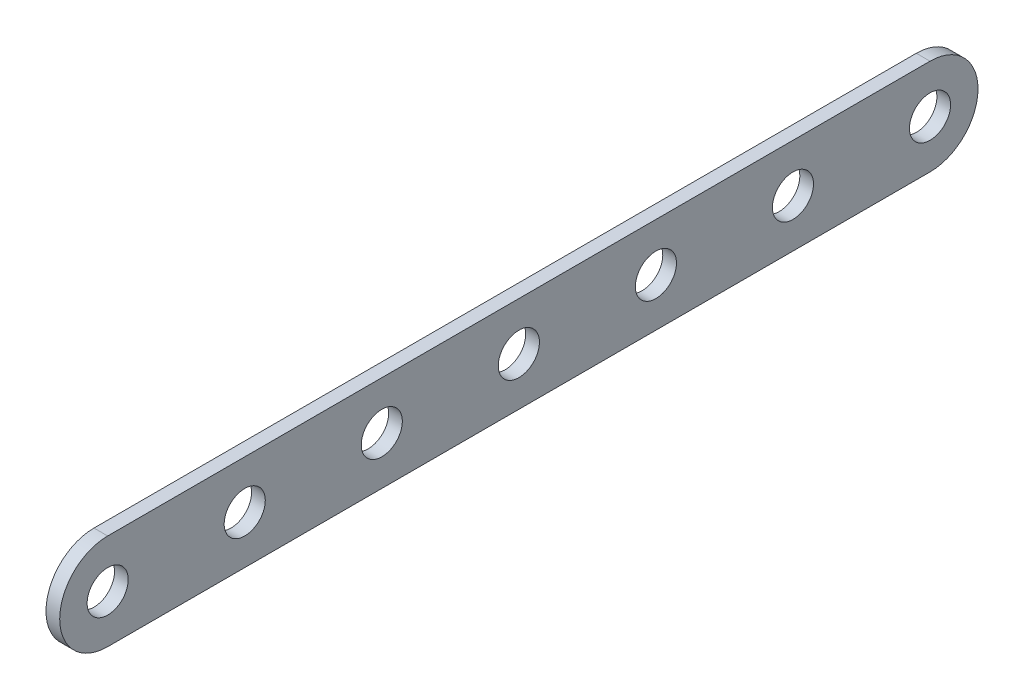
ISO-10303-21;
HEADER;
FILE_DESCRIPTION(('STEP AP214'),'2;1');
FILE_NAME('part.step','',(''),(''),'','','');
FILE_SCHEMA(('AUTOMOTIVE_DESIGN { 1 0 10303 214 1 1 1 1 }'));
ENDSEC;
DATA;
#1=APPLICATION_CONTEXT('core data for automotive mechanical design processes');
#2=APPLICATION_PROTOCOL_DEFINITION('international standard','automotive_design',2000,#1);
#3=PRODUCT_CONTEXT('',#1,'mechanical');
#4=PRODUCT('Part','Part','',(#3));
#5=PRODUCT_RELATED_PRODUCT_CATEGORY('part','',(#4));
#6=PRODUCT_DEFINITION_FORMATION('','',#4);
#7=PRODUCT_DEFINITION_CONTEXT('part definition',#1,'design');
#8=PRODUCT_DEFINITION('design','',#6,#7);
#9=PRODUCT_DEFINITION_SHAPE('','',#8);
#10=(LENGTH_UNIT() NAMED_UNIT(*) SI_UNIT(.MILLI.,.METRE.));
#11=(NAMED_UNIT(*) PLANE_ANGLE_UNIT() SI_UNIT($,.RADIAN.));
#12=(NAMED_UNIT(*) SI_UNIT($,.STERADIAN.) SOLID_ANGLE_UNIT());
#13=UNCERTAINTY_MEASURE_WITH_UNIT(LENGTH_MEASURE(1.E-05),#10,'distance_accuracy_value','');
#14=(GEOMETRIC_REPRESENTATION_CONTEXT(3) GLOBAL_UNCERTAINTY_ASSIGNED_CONTEXT((#13)) GLOBAL_UNIT_ASSIGNED_CONTEXT((#10,
#11,#12)) REPRESENTATION_CONTEXT('',''));
#15=CARTESIAN_POINT('',(0.,0.,0.));
#16=DIRECTION('',(0.,0.,1.));
#17=DIRECTION('',(1.,0.,0.));
#18=AXIS2_PLACEMENT_3D('',#15,#16,#17);
#19=CARTESIAN_POINT('',(1.,0.,0.));
#20=DIRECTION('',(1.,0.,0.));
#21=DIRECTION('',(0.,0.,-1.));
#22=AXIS2_PLACEMENT_3D('',#19,#20,#21);
#23=PLANE('',#22);
#24=CARTESIAN_POINT('',(1.,0.,-50.));
#25=DIRECTION('',(1.,0.,0.));
#26=DIRECTION('',(0.,0.,-1.));
#27=AXIS2_PLACEMENT_3D('',#24,#25,#26);
#28=CIRCLE('',#27,1.5);
#29=CARTESIAN_POINT('',(1.,0.,-51.5));
#30=VERTEX_POINT('',#29);
#31=EDGE_CURVE('E156',#30,#30,#28,.T.);
#32=ORIENTED_EDGE('',*,*,#31,.F.);
#33=EDGE_LOOP('',(#32));
#34=FACE_BOUND('',#33,.T.);
#35=CARTESIAN_POINT('',(1.,0.,-20.));
#36=DIRECTION('',(1.,0.,0.));
#37=DIRECTION('',(0.,0.,-1.));
#38=AXIS2_PLACEMENT_3D('',#35,#36,#37);
#39=CIRCLE('',#38,1.5);
#40=CARTESIAN_POINT('',(1.,0.,-21.5));
#41=VERTEX_POINT('',#40);
#42=EDGE_CURVE('E143',#41,#41,#39,.T.);
#43=ORIENTED_EDGE('',*,*,#42,.F.);
#44=EDGE_LOOP('',(#43));
#45=FACE_BOUND('',#44,.T.);
#46=CARTESIAN_POINT('',(1.,0.,-40.));
#47=DIRECTION('',(1.,0.,0.));
#48=DIRECTION('',(0.,0.,-1.));
#49=AXIS2_PLACEMENT_3D('',#46,#47,#48);
#50=CIRCLE('',#49,1.5);
#51=CARTESIAN_POINT('',(1.,0.,-41.5));
#52=VERTEX_POINT('',#51);
#53=EDGE_CURVE('E129',#52,#52,#50,.T.);
#54=ORIENTED_EDGE('',*,*,#53,.F.);
#55=EDGE_LOOP('',(#54));
#56=FACE_BOUND('',#55,.T.);
#57=CARTESIAN_POINT('',(1.,0.,0.));
#58=DIRECTION('',(1.,0.,0.));
#59=DIRECTION('',(0.,0.,-1.));
#60=AXIS2_PLACEMENT_3D('',#57,#58,#59);
#61=CIRCLE('',#60,3.5);
#62=CARTESIAN_POINT('',(1.,3.5,0.));
#63=VERTEX_POINT('',#62);
#64=CARTESIAN_POINT('',(1.,-3.5,0.));
#65=VERTEX_POINT('',#64);
#66=EDGE_CURVE('E90',#63,#65,#61,.T.);
#67=ORIENTED_EDGE('',*,*,#66,.T.);
#68=DIRECTION('',(0.,0.,-1.));
#69=VECTOR('',#68,1.);
#70=CARTESIAN_POINT('',(1.,-3.5,0.));
#71=LINE('',#70,#69);
#72=CARTESIAN_POINT('',(1.,-3.5,-60.));
#73=VERTEX_POINT('',#72);
#74=EDGE_CURVE('E85',#65,#73,#71,.T.);
#75=ORIENTED_EDGE('',*,*,#74,.T.);
#76=CARTESIAN_POINT('',(1.,0.,-60.));
#77=DIRECTION('',(1.,0.,0.));
#78=DIRECTION('',(0.,0.,-1.));
#79=AXIS2_PLACEMENT_3D('',#76,#77,#78);
#80=CIRCLE('',#79,3.5);
#81=CARTESIAN_POINT('',(1.,3.5,-60.));
#82=VERTEX_POINT('',#81);
#83=EDGE_CURVE('E88',#73,#82,#80,.T.);
#84=ORIENTED_EDGE('',*,*,#83,.T.);
#85=DIRECTION('',(0.,0.,1.));
#86=VECTOR('',#85,1.);
#87=CARTESIAN_POINT('',(1.,3.5,0.));
#88=LINE('',#87,#86);
#89=EDGE_CURVE('E53',#82,#63,#88,.T.);
#90=ORIENTED_EDGE('',*,*,#89,.T.);
#91=EDGE_LOOP('',(#67,#75,#84,#90));
#92=FACE_BOUND('',#91,.T.);
#93=CARTESIAN_POINT('',(1.,0.,0.));
#94=DIRECTION('',(1.,0.,0.));
#95=DIRECTION('',(0.,0.,-1.));
#96=AXIS2_PLACEMENT_3D('',#93,#94,#95);
#97=CIRCLE('',#96,1.5);
#98=CARTESIAN_POINT('',(1.,0.,-1.5));
#99=VERTEX_POINT('',#98);
#100=EDGE_CURVE('E110',#99,#99,#97,.T.);
#101=ORIENTED_EDGE('',*,*,#100,.F.);
#102=EDGE_LOOP('',(#101));
#103=FACE_BOUND('',#102,.T.);
#104=CARTESIAN_POINT('',(1.,0.,-10.));
#105=DIRECTION('',(1.,0.,0.));
#106=DIRECTION('',(0.,0.,-1.));
#107=AXIS2_PLACEMENT_3D('',#104,#105,#106);
#108=CIRCLE('',#107,1.5);
#109=CARTESIAN_POINT('',(1.,0.,-11.5));
#110=VERTEX_POINT('',#109);
#111=EDGE_CURVE('E136',#110,#110,#108,.T.);
#112=ORIENTED_EDGE('',*,*,#111,.F.);
#113=EDGE_LOOP('',(#112));
#114=FACE_BOUND('',#113,.T.);
#115=CARTESIAN_POINT('',(1.,0.,-30.));
#116=DIRECTION('',(1.,0.,0.));
#117=DIRECTION('',(0.,0.,-1.));
#118=AXIS2_PLACEMENT_3D('',#115,#116,#117);
#119=CIRCLE('',#118,1.5);
#120=CARTESIAN_POINT('',(1.,0.,-31.5));
#121=VERTEX_POINT('',#120);
#122=EDGE_CURVE('E149',#121,#121,#119,.T.);
#123=ORIENTED_EDGE('',*,*,#122,.F.);
#124=EDGE_LOOP('',(#123));
#125=FACE_BOUND('',#124,.T.);
#126=CARTESIAN_POINT('',(1.,0.,-60.));
#127=DIRECTION('',(1.,0.,0.));
#128=DIRECTION('',(0.,0.,-1.));
#129=AXIS2_PLACEMENT_3D('',#126,#127,#128);
#130=CIRCLE('',#129,1.5);
#131=CARTESIAN_POINT('',(1.,0.,-61.5));
#132=VERTEX_POINT('',#131);
#133=EDGE_CURVE('E164',#132,#132,#130,.T.);
#134=ORIENTED_EDGE('',*,*,#133,.F.);
#135=EDGE_LOOP('',(#134));
#136=FACE_BOUND('',#135,.T.);
#137=ADVANCED_FACE('F36',(#34,#45,#56,#92,#103,#114,#125,#136),#23,.T.);
#138=CARTESIAN_POINT('',(0.,0.,0.));
#139=DIRECTION('',(1.,0.,0.));
#140=DIRECTION('',(0.,0.,-1.));
#141=AXIS2_PLACEMENT_3D('',#138,#139,#140);
#142=PLANE('',#141);
#143=CARTESIAN_POINT('',(0.,0.,0.));
#144=DIRECTION('',(1.,0.,0.));
#145=DIRECTION('',(0.,0.,-1.));
#146=AXIS2_PLACEMENT_3D('',#143,#144,#145);
#147=CIRCLE('',#146,3.5);
#148=CARTESIAN_POINT('',(0.,3.5,0.));
#149=VERTEX_POINT('',#148);
#150=CARTESIAN_POINT('',(0.,-3.5,0.));
#151=VERTEX_POINT('',#150);
#152=EDGE_CURVE('E107',#149,#151,#147,.T.);
#153=ORIENTED_EDGE('',*,*,#152,.F.);
#154=DIRECTION('',(0.,0.,1.));
#155=VECTOR('',#154,1.);
#156=CARTESIAN_POINT('',(0.,3.5,0.));
#157=LINE('',#156,#155);
#158=CARTESIAN_POINT('',(0.,3.5,-60.));
#159=VERTEX_POINT('',#158);
#160=EDGE_CURVE('E78',#159,#149,#157,.T.);
#161=ORIENTED_EDGE('',*,*,#160,.F.);
#162=CARTESIAN_POINT('',(0.,0.,-60.));
#163=DIRECTION('',(1.,0.,0.));
#164=DIRECTION('',(0.,0.,-1.));
#165=AXIS2_PLACEMENT_3D('',#162,#163,#164);
#166=CIRCLE('',#165,3.5);
#167=CARTESIAN_POINT('',(0.,-3.5,-60.));
#168=VERTEX_POINT('',#167);
#169=EDGE_CURVE('E72',#168,#159,#166,.T.);
#170=ORIENTED_EDGE('',*,*,#169,.F.);
#171=DIRECTION('',(0.,0.,-1.));
#172=VECTOR('',#171,1.);
#173=CARTESIAN_POINT('',(0.,-3.5,0.));
#174=LINE('',#173,#172);
#175=EDGE_CURVE('E95',#151,#168,#174,.T.);
#176=ORIENTED_EDGE('',*,*,#175,.F.);
#177=EDGE_LOOP('',(#153,#161,#170,#176));
#178=FACE_BOUND('',#177,.T.);
#179=CARTESIAN_POINT('',(0.,0.,0.));
#180=DIRECTION('',(1.,0.,0.));
#181=DIRECTION('',(0.,0.,-1.));
#182=AXIS2_PLACEMENT_3D('',#179,#180,#181);
#183=CIRCLE('',#182,1.5);
#184=CARTESIAN_POINT('',(0.,0.,-1.5));
#185=VERTEX_POINT('',#184);
#186=EDGE_CURVE('E126',#185,#185,#183,.T.);
#187=ORIENTED_EDGE('',*,*,#186,.T.);
#188=EDGE_LOOP('',(#187));
#189=FACE_BOUND('',#188,.T.);
#190=CARTESIAN_POINT('',(0.,0.,-40.));
#191=DIRECTION('',(1.,0.,0.));
#192=DIRECTION('',(0.,0.,-1.));
#193=AXIS2_PLACEMENT_3D('',#190,#191,#192);
#194=CIRCLE('',#193,1.5);
#195=CARTESIAN_POINT('',(0.,0.,-41.5));
#196=VERTEX_POINT('',#195);
#197=EDGE_CURVE('E132',#196,#196,#194,.T.);
#198=ORIENTED_EDGE('',*,*,#197,.T.);
#199=EDGE_LOOP('',(#198));
#200=FACE_BOUND('',#199,.T.);
#201=CARTESIAN_POINT('',(0.,0.,-10.));
#202=DIRECTION('',(1.,0.,0.));
#203=DIRECTION('',(0.,0.,-1.));
#204=AXIS2_PLACEMENT_3D('',#201,#202,#203);
#205=CIRCLE('',#204,1.5);
#206=CARTESIAN_POINT('',(0.,0.,-11.5));
#207=VERTEX_POINT('',#206);
#208=EDGE_CURVE('E140',#207,#207,#205,.T.);
#209=ORIENTED_EDGE('',*,*,#208,.T.);
#210=EDGE_LOOP('',(#209));
#211=FACE_BOUND('',#210,.T.);
#212=CARTESIAN_POINT('',(0.,0.,-20.));
#213=DIRECTION('',(1.,0.,0.));
#214=DIRECTION('',(0.,0.,-1.));
#215=AXIS2_PLACEMENT_3D('',#212,#213,#214);
#216=CIRCLE('',#215,1.5);
#217=CARTESIAN_POINT('',(0.,0.,-21.5));
#218=VERTEX_POINT('',#217);
#219=EDGE_CURVE('E146',#218,#218,#216,.T.);
#220=ORIENTED_EDGE('',*,*,#219,.T.);
#221=EDGE_LOOP('',(#220));
#222=FACE_BOUND('',#221,.T.);
#223=CARTESIAN_POINT('',(0.,0.,-30.));
#224=DIRECTION('',(1.,0.,0.));
#225=DIRECTION('',(0.,0.,-1.));
#226=AXIS2_PLACEMENT_3D('',#223,#224,#225);
#227=CIRCLE('',#226,1.5);
#228=CARTESIAN_POINT('',(0.,0.,-31.5));
#229=VERTEX_POINT('',#228);
#230=EDGE_CURVE('E152',#229,#229,#227,.T.);
#231=ORIENTED_EDGE('',*,*,#230,.T.);
#232=EDGE_LOOP('',(#231));
#233=FACE_BOUND('',#232,.T.);
#234=CARTESIAN_POINT('',(0.,0.,-50.));
#235=DIRECTION('',(1.,0.,0.));
#236=DIRECTION('',(0.,0.,-1.));
#237=AXIS2_PLACEMENT_3D('',#234,#235,#236);
#238=CIRCLE('',#237,1.5);
#239=CARTESIAN_POINT('',(0.,0.,-51.5));
#240=VERTEX_POINT('',#239);
#241=EDGE_CURVE('E160',#240,#240,#238,.T.);
#242=ORIENTED_EDGE('',*,*,#241,.T.);
#243=EDGE_LOOP('',(#242));
#244=FACE_BOUND('',#243,.T.);
#245=CARTESIAN_POINT('',(0.,0.,-60.));
#246=DIRECTION('',(1.,0.,0.));
#247=DIRECTION('',(0.,0.,-1.));
#248=AXIS2_PLACEMENT_3D('',#245,#246,#247);
#249=CIRCLE('',#248,1.5);
#250=CARTESIAN_POINT('',(0.,0.,-61.5));
#251=VERTEX_POINT('',#250);
#252=EDGE_CURVE('E168',#251,#251,#249,.T.);
#253=ORIENTED_EDGE('',*,*,#252,.T.);
#254=EDGE_LOOP('',(#253));
#255=FACE_BOUND('',#254,.T.);
#256=ADVANCED_FACE('F122',(#178,#189,#200,#211,#222,#233,#244,#255),#142,.F.);
#257=CARTESIAN_POINT('',(1.,0.,0.));
#258=DIRECTION('',(-1.,0.,0.));
#259=DIRECTION('',(0.,0.,1.));
#260=AXIS2_PLACEMENT_3D('',#257,#258,#259);
#261=CYLINDRICAL_SURFACE('',#260,3.5);
#262=ORIENTED_EDGE('',*,*,#152,.T.);
#263=DIRECTION('',(-1.,0.,0.));
#264=VECTOR('',#263,1.);
#265=CARTESIAN_POINT('',(1.,-3.5,0.));
#266=LINE('',#265,#264);
#267=EDGE_CURVE('E11',#65,#151,#266,.T.);
#268=ORIENTED_EDGE('',*,*,#267,.F.);
#269=ORIENTED_EDGE('',*,*,#66,.F.);
#270=DIRECTION('',(-1.,0.,0.));
#271=VECTOR('',#270,1.);
#272=CARTESIAN_POINT('',(1.,3.5,0.));
#273=LINE('',#272,#271);
#274=EDGE_CURVE('E103',#63,#149,#273,.T.);
#275=ORIENTED_EDGE('',*,*,#274,.T.);
#276=EDGE_LOOP('',(#262,#268,#269,#275));
#277=FACE_BOUND('',#276,.T.);
#278=ADVANCED_FACE('F38',(#277),#261,.T.);
#279=CARTESIAN_POINT('',(1.,-3.5,0.));
#280=DIRECTION('',(0.,1.,0.));
#281=DIRECTION('',(0.,0.,1.));
#282=AXIS2_PLACEMENT_3D('',#279,#280,#281);
#283=PLANE('',#282);
#284=ORIENTED_EDGE('',*,*,#175,.T.);
#285=DIRECTION('',(-1.,0.,0.));
#286=VECTOR('',#285,1.);
#287=CARTESIAN_POINT('',(1.,-3.5,-60.));
#288=LINE('',#287,#286);
#289=EDGE_CURVE('E45',#73,#168,#288,.T.);
#290=ORIENTED_EDGE('',*,*,#289,.F.);
#291=ORIENTED_EDGE('',*,*,#74,.F.);
#292=ORIENTED_EDGE('',*,*,#267,.T.);
#293=EDGE_LOOP('',(#284,#290,#291,#292));
#294=FACE_BOUND('',#293,.T.);
#295=ADVANCED_FACE('F94',(#294),#283,.F.);
#296=CARTESIAN_POINT('',(1.,0.,-60.));
#297=DIRECTION('',(-1.,0.,0.));
#298=DIRECTION('',(0.,0.,1.));
#299=AXIS2_PLACEMENT_3D('',#296,#297,#298);
#300=CYLINDRICAL_SURFACE('',#299,3.5);
#301=ORIENTED_EDGE('',*,*,#169,.T.);
#302=DIRECTION('',(-1.,0.,0.));
#303=VECTOR('',#302,1.);
#304=CARTESIAN_POINT('',(1.,3.5,-60.));
#305=LINE('',#304,#303);
#306=EDGE_CURVE('E96',#82,#159,#305,.T.);
#307=ORIENTED_EDGE('',*,*,#306,.F.);
#308=ORIENTED_EDGE('',*,*,#83,.F.);
#309=ORIENTED_EDGE('',*,*,#289,.T.);
#310=EDGE_LOOP('',(#301,#307,#308,#309));
#311=FACE_BOUND('',#310,.T.);
#312=ADVANCED_FACE('F97',(#311),#300,.T.);
#313=CARTESIAN_POINT('',(1.,3.5,0.));
#314=DIRECTION('',(0.,-1.,0.));
#315=DIRECTION('',(0.,0.,-1.));
#316=AXIS2_PLACEMENT_3D('',#313,#314,#315);
#317=PLANE('',#316);
#318=ORIENTED_EDGE('',*,*,#160,.T.);
#319=ORIENTED_EDGE('',*,*,#274,.F.);
#320=ORIENTED_EDGE('',*,*,#89,.F.);
#321=ORIENTED_EDGE('',*,*,#306,.T.);
#322=EDGE_LOOP('',(#318,#319,#320,#321));
#323=FACE_BOUND('',#322,.T.);
#324=ADVANCED_FACE('F119',(#323),#317,.F.);
#325=CARTESIAN_POINT('',(1.,0.,0.));
#326=DIRECTION('',(-1.,0.,0.));
#327=DIRECTION('',(0.,0.,1.));
#328=AXIS2_PLACEMENT_3D('',#325,#326,#327);
#329=CYLINDRICAL_SURFACE('',#328,1.5);
#330=ORIENTED_EDGE('',*,*,#100,.T.);
#331=EDGE_LOOP('',(#330));
#332=FACE_BOUND('',#331,.T.);
#333=ORIENTED_EDGE('',*,*,#186,.F.);
#334=EDGE_LOOP('',(#333));
#335=FACE_BOUND('',#334,.T.);
#336=ADVANCED_FACE('F187',(#332,#335),#329,.F.);
#337=CARTESIAN_POINT('',(1.,0.,-40.));
#338=DIRECTION('',(-1.,0.,0.));
#339=DIRECTION('',(0.,0.,1.));
#340=AXIS2_PLACEMENT_3D('',#337,#338,#339);
#341=CYLINDRICAL_SURFACE('',#340,1.5);
#342=ORIENTED_EDGE('',*,*,#53,.T.);
#343=EDGE_LOOP('',(#342));
#344=FACE_BOUND('',#343,.T.);
#345=ORIENTED_EDGE('',*,*,#197,.F.);
#346=EDGE_LOOP('',(#345));
#347=FACE_BOUND('',#346,.T.);
#348=ADVANCED_FACE('F233',(#344,#347),#341,.F.);
#349=CARTESIAN_POINT('',(1.,0.,-10.));
#350=DIRECTION('',(-1.,0.,0.));
#351=DIRECTION('',(0.,0.,1.));
#352=AXIS2_PLACEMENT_3D('',#349,#350,#351);
#353=CYLINDRICAL_SURFACE('',#352,1.5);
#354=ORIENTED_EDGE('',*,*,#111,.T.);
#355=EDGE_LOOP('',(#354));
#356=FACE_BOUND('',#355,.T.);
#357=ORIENTED_EDGE('',*,*,#208,.F.);
#358=EDGE_LOOP('',(#357));
#359=FACE_BOUND('',#358,.T.);
#360=ADVANCED_FACE('F241',(#356,#359),#353,.F.);
#361=CARTESIAN_POINT('',(1.,0.,-20.));
#362=DIRECTION('',(-1.,0.,0.));
#363=DIRECTION('',(0.,0.,1.));
#364=AXIS2_PLACEMENT_3D('',#361,#362,#363);
#365=CYLINDRICAL_SURFACE('',#364,1.5);
#366=ORIENTED_EDGE('',*,*,#42,.T.);
#367=EDGE_LOOP('',(#366));
#368=FACE_BOUND('',#367,.T.);
#369=ORIENTED_EDGE('',*,*,#219,.F.);
#370=EDGE_LOOP('',(#369));
#371=FACE_BOUND('',#370,.T.);
#372=ADVANCED_FACE('F249',(#368,#371),#365,.F.);
#373=CARTESIAN_POINT('',(1.,0.,-30.));
#374=DIRECTION('',(-1.,0.,0.));
#375=DIRECTION('',(0.,0.,1.));
#376=AXIS2_PLACEMENT_3D('',#373,#374,#375);
#377=CYLINDRICAL_SURFACE('',#376,1.5);
#378=ORIENTED_EDGE('',*,*,#122,.T.);
#379=EDGE_LOOP('',(#378));
#380=FACE_BOUND('',#379,.T.);
#381=ORIENTED_EDGE('',*,*,#230,.F.);
#382=EDGE_LOOP('',(#381));
#383=FACE_BOUND('',#382,.T.);
#384=ADVANCED_FACE('F258',(#380,#383),#377,.F.);
#385=CARTESIAN_POINT('',(1.,0.,-50.));
#386=DIRECTION('',(-1.,0.,0.));
#387=DIRECTION('',(0.,0.,1.));
#388=AXIS2_PLACEMENT_3D('',#385,#386,#387);
#389=CYLINDRICAL_SURFACE('',#388,1.5);
#390=ORIENTED_EDGE('',*,*,#31,.T.);
#391=EDGE_LOOP('',(#390));
#392=FACE_BOUND('',#391,.T.);
#393=ORIENTED_EDGE('',*,*,#241,.F.);
#394=EDGE_LOOP('',(#393));
#395=FACE_BOUND('',#394,.T.);
#396=ADVANCED_FACE('F267',(#392,#395),#389,.F.);
#397=CARTESIAN_POINT('',(1.,0.,-60.));
#398=DIRECTION('',(-1.,0.,0.));
#399=DIRECTION('',(0.,0.,1.));
#400=AXIS2_PLACEMENT_3D('',#397,#398,#399);
#401=CYLINDRICAL_SURFACE('',#400,1.5);
#402=ORIENTED_EDGE('',*,*,#133,.T.);
#403=EDGE_LOOP('',(#402));
#404=FACE_BOUND('',#403,.T.);
#405=ORIENTED_EDGE('',*,*,#252,.F.);
#406=EDGE_LOOP('',(#405));
#407=FACE_BOUND('',#406,.T.);
#408=ADVANCED_FACE('F174',(#404,#407),#401,.F.);
#409=CLOSED_SHELL('',(#137,#256,#278,#295,#312,#324,#336,#348,#360,#372,#384,#396,#408));
#410=MANIFOLD_SOLID_BREP('B2',#409);
#411=ADVANCED_BREP_SHAPE_REPRESENTATION('',(#18,#410),#14);
#412=SHAPE_DEFINITION_REPRESENTATION(#9,#411);
ENDSEC;
END-ISO-10303-21;
